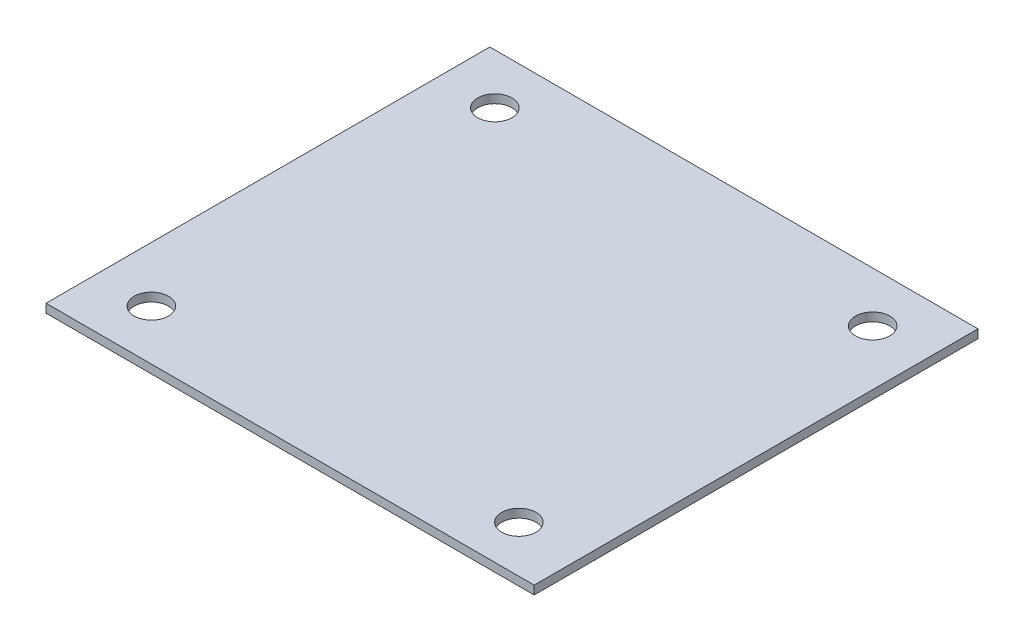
ISO-10303-21;
HEADER;
FILE_DESCRIPTION(('STEP AP214'),'2;1');
FILE_NAME('part.step','',(''),(''),'','','');
FILE_SCHEMA(('AUTOMOTIVE_DESIGN { 1 0 10303 214 1 1 1 1 }'));
ENDSEC;
DATA;
#1=APPLICATION_CONTEXT('core data for automotive mechanical design processes');
#2=APPLICATION_PROTOCOL_DEFINITION('international standard','automotive_design',2000,#1);
#3=PRODUCT_CONTEXT('',#1,'mechanical');
#4=PRODUCT('Part','Part','',(#3));
#5=PRODUCT_RELATED_PRODUCT_CATEGORY('part','',(#4));
#6=PRODUCT_DEFINITION_FORMATION('','',#4);
#7=PRODUCT_DEFINITION_CONTEXT('part definition',#1,'design');
#8=PRODUCT_DEFINITION('design','',#6,#7);
#9=PRODUCT_DEFINITION_SHAPE('','',#8);
#10=(LENGTH_UNIT() NAMED_UNIT(*) SI_UNIT(.MILLI.,.METRE.));
#11=(NAMED_UNIT(*) PLANE_ANGLE_UNIT() SI_UNIT($,.RADIAN.));
#12=(NAMED_UNIT(*) SI_UNIT($,.STERADIAN.) SOLID_ANGLE_UNIT());
#13=UNCERTAINTY_MEASURE_WITH_UNIT(LENGTH_MEASURE(1.E-05),#10,'distance_accuracy_value','');
#14=(GEOMETRIC_REPRESENTATION_CONTEXT(3) GLOBAL_UNCERTAINTY_ASSIGNED_CONTEXT((#13)) GLOBAL_UNIT_ASSIGNED_CONTEXT((#10,
#11,#12)) REPRESENTATION_CONTEXT('',''));
#15=CARTESIAN_POINT('',(0.,0.,0.));
#16=DIRECTION('',(0.,0.,1.));
#17=DIRECTION('',(1.,0.,0.));
#18=AXIS2_PLACEMENT_3D('',#15,#16,#17);
#19=CARTESIAN_POINT('',(71.0664000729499,-2.5,-64.6058182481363));
#20=DIRECTION('',(1.,0.,0.));
#21=DIRECTION('',(0.,0.,-1.));
#22=AXIS2_PLACEMENT_3D('',#19,#20,#21);
#23=PLANE('',#22);
#24=DIRECTION('',(0.,0.,-1.));
#25=VECTOR('',#24,1.);
#26=CARTESIAN_POINT('',(71.0664000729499,0.,-64.6058182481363));
#27=LINE('',#26,#25);
#28=CARTESIAN_POINT('',(71.0664000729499,0.,64.6058182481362));
#29=VERTEX_POINT('',#28);
#30=CARTESIAN_POINT('',(71.0664000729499,0.,-64.6058182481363));
#31=VERTEX_POINT('',#30);
#32=EDGE_CURVE('E116',#29,#31,#27,.T.);
#33=ORIENTED_EDGE('',*,*,#32,.F.);
#34=DIRECTION('',(0.,1.,0.));
#35=VECTOR('',#34,1.);
#36=CARTESIAN_POINT('',(71.0664000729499,-2.5,64.6058182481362));
#37=LINE('',#36,#35);
#38=CARTESIAN_POINT('',(71.0664000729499,-2.5,64.6058182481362));
#39=VERTEX_POINT('',#38);
#40=EDGE_CURVE('E11',#39,#29,#37,.T.);
#41=ORIENTED_EDGE('',*,*,#40,.F.);
#42=DIRECTION('',(0.,0.,-1.));
#43=VECTOR('',#42,1.);
#44=CARTESIAN_POINT('',(71.0664000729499,-2.5,-64.6058182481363));
#45=LINE('',#44,#43);
#46=CARTESIAN_POINT('',(71.0664000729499,-2.5,-64.6058182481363));
#47=VERTEX_POINT('',#46);
#48=EDGE_CURVE('E107',#39,#47,#45,.T.);
#49=ORIENTED_EDGE('',*,*,#48,.T.);
#50=DIRECTION('',(0.,1.,0.));
#51=VECTOR('',#50,1.);
#52=CARTESIAN_POINT('',(71.0664000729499,-2.5,-64.6058182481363));
#53=LINE('',#52,#51);
#54=EDGE_CURVE('E48',#47,#31,#53,.T.);
#55=ORIENTED_EDGE('',*,*,#54,.T.);
#56=EDGE_LOOP('',(#33,#41,#49,#55));
#57=FACE_BOUND('',#56,.T.);
#58=ADVANCED_FACE('F45',(#57),#23,.T.);
#59=CARTESIAN_POINT('',(-71.0664000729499,-2.5,64.6058182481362));
#60=DIRECTION('',(0.,0.,1.));
#61=DIRECTION('',(1.,0.,0.));
#62=AXIS2_PLACEMENT_3D('',#59,#60,#61);
#63=PLANE('',#62);
#64=DIRECTION('',(1.,0.,0.));
#65=VECTOR('',#64,1.);
#66=CARTESIAN_POINT('',(-71.0664000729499,0.,64.6058182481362));
#67=LINE('',#66,#65);
#68=CARTESIAN_POINT('',(-71.0664000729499,0.,64.6058182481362));
#69=VERTEX_POINT('',#68);
#70=EDGE_CURVE('E110',#69,#29,#67,.T.);
#71=ORIENTED_EDGE('',*,*,#70,.F.);
#72=DIRECTION('',(0.,1.,0.));
#73=VECTOR('',#72,1.);
#74=CARTESIAN_POINT('',(-71.0664000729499,-2.5,64.6058182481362));
#75=LINE('',#74,#73);
#76=CARTESIAN_POINT('',(-71.0664000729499,-2.5,64.6058182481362));
#77=VERTEX_POINT('',#76);
#78=EDGE_CURVE('E55',#77,#69,#75,.T.);
#79=ORIENTED_EDGE('',*,*,#78,.F.);
#80=DIRECTION('',(1.,0.,0.));
#81=VECTOR('',#80,1.);
#82=CARTESIAN_POINT('',(-71.0664000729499,-2.5,64.6058182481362));
#83=LINE('',#82,#81);
#84=EDGE_CURVE('E102',#77,#39,#83,.T.);
#85=ORIENTED_EDGE('',*,*,#84,.T.);
#86=ORIENTED_EDGE('',*,*,#40,.T.);
#87=EDGE_LOOP('',(#71,#79,#85,#86));
#88=FACE_BOUND('',#87,.T.);
#89=ADVANCED_FACE('F133',(#88),#63,.T.);
#90=CARTESIAN_POINT('',(-71.0664000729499,-2.5,-64.6058182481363));
#91=DIRECTION('',(-1.,0.,0.));
#92=DIRECTION('',(0.,0.,1.));
#93=AXIS2_PLACEMENT_3D('',#90,#91,#92);
#94=PLANE('',#93);
#95=DIRECTION('',(0.,0.,1.));
#96=VECTOR('',#95,1.);
#97=CARTESIAN_POINT('',(-71.0664000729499,0.,-64.6058182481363));
#98=LINE('',#97,#96);
#99=CARTESIAN_POINT('',(-71.0664000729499,0.,-64.6058182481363));
#100=VERTEX_POINT('',#99);
#101=EDGE_CURVE('E96',#100,#69,#98,.T.);
#102=ORIENTED_EDGE('',*,*,#101,.F.);
#103=DIRECTION('',(0.,1.,0.));
#104=VECTOR('',#103,1.);
#105=CARTESIAN_POINT('',(-71.0664000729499,-2.5,-64.6058182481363));
#106=LINE('',#105,#104);
#107=CARTESIAN_POINT('',(-71.0664000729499,-2.5,-64.6058182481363));
#108=VERTEX_POINT('',#107);
#109=EDGE_CURVE('E91',#108,#100,#106,.T.);
#110=ORIENTED_EDGE('',*,*,#109,.F.);
#111=DIRECTION('',(0.,0.,1.));
#112=VECTOR('',#111,1.);
#113=CARTESIAN_POINT('',(-71.0664000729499,-2.5,-64.6058182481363));
#114=LINE('',#113,#112);
#115=EDGE_CURVE('E94',#108,#77,#114,.T.);
#116=ORIENTED_EDGE('',*,*,#115,.T.);
#117=ORIENTED_EDGE('',*,*,#78,.T.);
#118=EDGE_LOOP('',(#102,#110,#116,#117));
#119=FACE_BOUND('',#118,.T.);
#120=ADVANCED_FACE('F93',(#119),#94,.T.);
#121=CARTESIAN_POINT('',(-71.0664000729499,-2.5,-64.6058182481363));
#122=DIRECTION('',(0.,0.,-1.));
#123=DIRECTION('',(-1.,0.,0.));
#124=AXIS2_PLACEMENT_3D('',#121,#122,#123);
#125=PLANE('',#124);
#126=DIRECTION('',(-1.,0.,0.));
#127=VECTOR('',#126,1.);
#128=CARTESIAN_POINT('',(-71.0664000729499,0.,-64.6058182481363));
#129=LINE('',#128,#127);
#130=EDGE_CURVE('E120',#31,#100,#129,.T.);
#131=ORIENTED_EDGE('',*,*,#130,.F.);
#132=ORIENTED_EDGE('',*,*,#54,.F.);
#133=DIRECTION('',(-1.,0.,0.));
#134=VECTOR('',#133,1.);
#135=CARTESIAN_POINT('',(-71.0664000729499,-2.5,-64.6058182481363));
#136=LINE('',#135,#134);
#137=EDGE_CURVE('E101',#47,#108,#136,.T.);
#138=ORIENTED_EDGE('',*,*,#137,.T.);
#139=ORIENTED_EDGE('',*,*,#109,.T.);
#140=EDGE_LOOP('',(#131,#132,#138,#139));
#141=FACE_BOUND('',#140,.T.);
#142=ADVANCED_FACE('F105',(#141),#125,.T.);
#143=CARTESIAN_POINT('',(0.,-2.5,0.));
#144=DIRECTION('',(0.,1.,0.));
#145=DIRECTION('',(0.,0.,1.));
#146=AXIS2_PLACEMENT_3D('',#143,#144,#145);
#147=PLANE('',#146);
#148=CARTESIAN_POINT('',(55.,-2.5,-50.));
#149=DIRECTION('',(0.,1.,0.));
#150=DIRECTION('',(0.,0.,1.));
#151=AXIS2_PLACEMENT_3D('',#148,#149,#150);
#152=CIRCLE('',#151,5.);
#153=CARTESIAN_POINT('',(55.,-2.5,-45.));
#154=VERTEX_POINT('',#153);
#155=EDGE_CURVE('E174',#154,#154,#152,.T.);
#156=ORIENTED_EDGE('',*,*,#155,.T.);
#157=EDGE_LOOP('',(#156));
#158=FACE_BOUND('',#157,.T.);
#159=CARTESIAN_POINT('',(-55.,-2.5,-50.));
#160=DIRECTION('',(0.,1.,0.));
#161=DIRECTION('',(0.,0.,1.));
#162=AXIS2_PLACEMENT_3D('',#159,#160,#161);
#163=CIRCLE('',#162,5.);
#164=CARTESIAN_POINT('',(-55.,-2.5,-45.));
#165=VERTEX_POINT('',#164);
#166=EDGE_CURVE('E184',#165,#165,#163,.T.);
#167=ORIENTED_EDGE('',*,*,#166,.T.);
#168=EDGE_LOOP('',(#167));
#169=FACE_BOUND('',#168,.T.);
#170=CARTESIAN_POINT('',(53.,-2.5,51.));
#171=DIRECTION('',(0.,1.,0.));
#172=DIRECTION('',(0.,0.,1.));
#173=AXIS2_PLACEMENT_3D('',#170,#171,#172);
#174=CIRCLE('',#173,5.);
#175=CARTESIAN_POINT('',(53.,-2.5,56.));
#176=VERTEX_POINT('',#175);
#177=EDGE_CURVE('E192',#176,#176,#174,.T.);
#178=ORIENTED_EDGE('',*,*,#177,.T.);
#179=EDGE_LOOP('',(#178));
#180=FACE_BOUND('',#179,.T.);
#181=CARTESIAN_POINT('',(-54.9984254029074,-2.5,49.9985685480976));
#182=DIRECTION('',(0.,1.,0.));
#183=DIRECTION('',(0.,0.,1.));
#184=AXIS2_PLACEMENT_3D('',#181,#182,#183);
#185=CIRCLE('',#184,5.);
#186=CARTESIAN_POINT('',(-54.9984254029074,-2.5,54.9985685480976));
#187=VERTEX_POINT('',#186);
#188=EDGE_CURVE('E121',#187,#187,#185,.T.);
#189=ORIENTED_EDGE('',*,*,#188,.T.);
#190=EDGE_LOOP('',(#189));
#191=FACE_BOUND('',#190,.T.);
#192=ORIENTED_EDGE('',*,*,#48,.F.);
#193=ORIENTED_EDGE('',*,*,#84,.F.);
#194=ORIENTED_EDGE('',*,*,#115,.F.);
#195=ORIENTED_EDGE('',*,*,#137,.F.);
#196=EDGE_LOOP('',(#192,#193,#194,#195));
#197=FACE_BOUND('',#196,.T.);
#198=ADVANCED_FACE('F100',(#158,#169,#180,#191,#197),#147,.F.);
#199=CARTESIAN_POINT('',(0.,0.,0.));
#200=DIRECTION('',(0.,1.,0.));
#201=DIRECTION('',(0.,0.,1.));
#202=AXIS2_PLACEMENT_3D('',#199,#200,#201);
#203=PLANE('',#202);
#204=CARTESIAN_POINT('',(55.,0.,-50.));
#205=DIRECTION('',(0.,1.,0.));
#206=DIRECTION('',(0.,0.,1.));
#207=AXIS2_PLACEMENT_3D('',#204,#205,#206);
#208=CIRCLE('',#207,5.);
#209=CARTESIAN_POINT('',(55.,0.,-45.));
#210=VERTEX_POINT('',#209);
#211=EDGE_CURVE('E177',#210,#210,#208,.T.);
#212=ORIENTED_EDGE('',*,*,#211,.F.);
#213=EDGE_LOOP('',(#212));
#214=FACE_BOUND('',#213,.T.);
#215=CARTESIAN_POINT('',(-55.,0.,-50.));
#216=DIRECTION('',(0.,1.,0.));
#217=DIRECTION('',(0.,0.,1.));
#218=AXIS2_PLACEMENT_3D('',#215,#216,#217);
#219=CIRCLE('',#218,5.);
#220=CARTESIAN_POINT('',(-55.,0.,-45.));
#221=VERTEX_POINT('',#220);
#222=EDGE_CURVE('E181',#221,#221,#219,.T.);
#223=ORIENTED_EDGE('',*,*,#222,.F.);
#224=EDGE_LOOP('',(#223));
#225=FACE_BOUND('',#224,.T.);
#226=CARTESIAN_POINT('',(53.,0.,51.));
#227=DIRECTION('',(0.,1.,0.));
#228=DIRECTION('',(0.,0.,1.));
#229=AXIS2_PLACEMENT_3D('',#226,#227,#228);
#230=CIRCLE('',#229,5.);
#231=CARTESIAN_POINT('',(53.,0.,56.));
#232=VERTEX_POINT('',#231);
#233=EDGE_CURVE('E188',#232,#232,#230,.T.);
#234=ORIENTED_EDGE('',*,*,#233,.F.);
#235=EDGE_LOOP('',(#234));
#236=FACE_BOUND('',#235,.T.);
#237=CARTESIAN_POINT('',(-54.9984254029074,0.,49.9985685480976));
#238=DIRECTION('',(0.,1.,0.));
#239=DIRECTION('',(0.,0.,1.));
#240=AXIS2_PLACEMENT_3D('',#237,#238,#239);
#241=CIRCLE('',#240,5.);
#242=CARTESIAN_POINT('',(-54.9984254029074,0.,54.9985685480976));
#243=VERTEX_POINT('',#242);
#244=EDGE_CURVE('E196',#243,#243,#241,.T.);
#245=ORIENTED_EDGE('',*,*,#244,.F.);
#246=EDGE_LOOP('',(#245));
#247=FACE_BOUND('',#246,.T.);
#248=ORIENTED_EDGE('',*,*,#32,.T.);
#249=ORIENTED_EDGE('',*,*,#130,.T.);
#250=ORIENTED_EDGE('',*,*,#101,.T.);
#251=ORIENTED_EDGE('',*,*,#70,.T.);
#252=EDGE_LOOP('',(#248,#249,#250,#251));
#253=FACE_BOUND('',#252,.T.);
#254=ADVANCED_FACE('F132',(#214,#225,#236,#247,#253),#203,.T.);
#255=CARTESIAN_POINT('',(-54.9984254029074,-2.5,49.9985685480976));
#256=DIRECTION('',(0.,1.,0.));
#257=DIRECTION('',(0.,0.,1.));
#258=AXIS2_PLACEMENT_3D('',#255,#256,#257);
#259=CYLINDRICAL_SURFACE('',#258,5.);
#260=ORIENTED_EDGE('',*,*,#188,.F.);
#261=EDGE_LOOP('',(#260));
#262=FACE_BOUND('',#261,.T.);
#263=ORIENTED_EDGE('',*,*,#244,.T.);
#264=EDGE_LOOP('',(#263));
#265=FACE_BOUND('',#264,.T.);
#266=ADVANCED_FACE('F151',(#262,#265),#259,.F.);
#267=CARTESIAN_POINT('',(53.,-2.5,51.));
#268=DIRECTION('',(0.,1.,0.));
#269=DIRECTION('',(0.,0.,1.));
#270=AXIS2_PLACEMENT_3D('',#267,#268,#269);
#271=CYLINDRICAL_SURFACE('',#270,5.);
#272=ORIENTED_EDGE('',*,*,#177,.F.);
#273=EDGE_LOOP('',(#272));
#274=FACE_BOUND('',#273,.T.);
#275=ORIENTED_EDGE('',*,*,#233,.T.);
#276=EDGE_LOOP('',(#275));
#277=FACE_BOUND('',#276,.T.);
#278=ADVANCED_FACE('F158',(#274,#277),#271,.F.);
#279=CARTESIAN_POINT('',(-55.,-2.5,-50.));
#280=DIRECTION('',(0.,1.,0.));
#281=DIRECTION('',(0.,0.,1.));
#282=AXIS2_PLACEMENT_3D('',#279,#280,#281);
#283=CYLINDRICAL_SURFACE('',#282,5.);
#284=ORIENTED_EDGE('',*,*,#166,.F.);
#285=EDGE_LOOP('',(#284));
#286=FACE_BOUND('',#285,.T.);
#287=ORIENTED_EDGE('',*,*,#222,.T.);
#288=EDGE_LOOP('',(#287));
#289=FACE_BOUND('',#288,.T.);
#290=ADVANCED_FACE('F162',(#286,#289),#283,.F.);
#291=CARTESIAN_POINT('',(55.,-2.5,-50.));
#292=DIRECTION('',(0.,1.,0.));
#293=DIRECTION('',(0.,0.,1.));
#294=AXIS2_PLACEMENT_3D('',#291,#292,#293);
#295=CYLINDRICAL_SURFACE('',#294,5.);
#296=ORIENTED_EDGE('',*,*,#155,.F.);
#297=EDGE_LOOP('',(#296));
#298=FACE_BOUND('',#297,.T.);
#299=ORIENTED_EDGE('',*,*,#211,.T.);
#300=EDGE_LOOP('',(#299));
#301=FACE_BOUND('',#300,.T.);
#302=ADVANCED_FACE('F166',(#298,#301),#295,.F.);
#303=CLOSED_SHELL('',(#58,#89,#120,#142,#198,#254,#266,#278,#290,#302));
#304=MANIFOLD_SOLID_BREP('B2',#303);
#305=ADVANCED_BREP_SHAPE_REPRESENTATION('',(#18,#304),#14);
#306=SHAPE_DEFINITION_REPRESENTATION(#9,#305);
ENDSEC;
END-ISO-10303-21;
